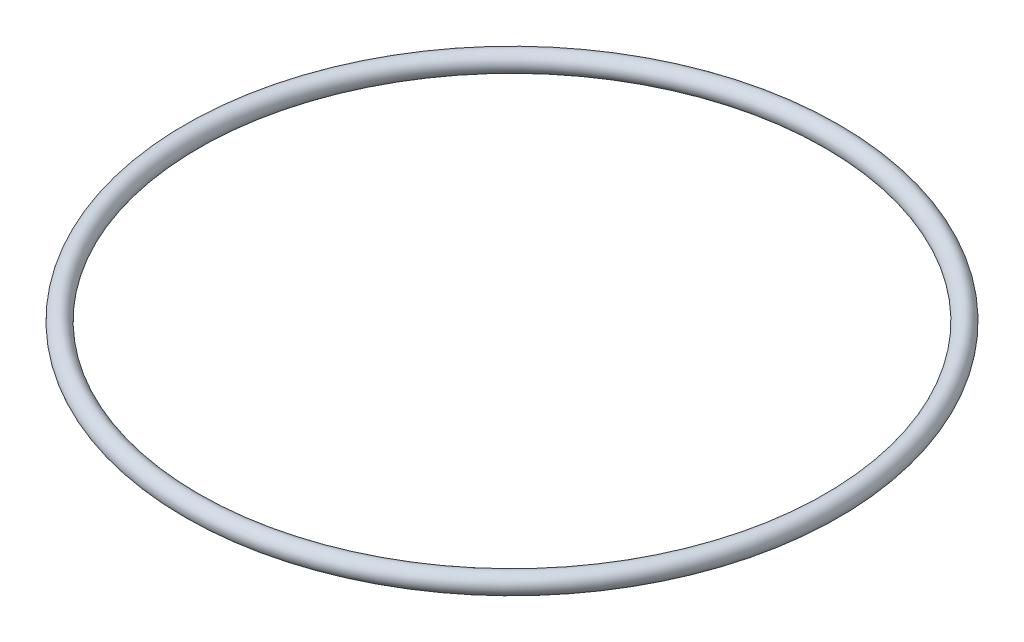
from build123d import *

# Parameters (mm, degrees)
SKETCH3_R = 1.524


with BuildPart() as part:
    # Sweep2: sweep along a path in Sketch4
    with BuildLine(Plane(origin=(0, 0, 0), x_dir=(1, 0, 0), z_dir=(0, 1, 0))) as sweep2_path:
        CenterArc((0, 0), 50.8, 0, 360)
    # Sketch3 → Sweep2 (sweep)
    with BuildSketch(Plane(origin=(0, 0, 0), x_dir=(0, 0, -1), z_dir=(1, 0, 0))):
        with Locations((-50.8, 0)):
            Circle(SKETCH3_R)
    sweep(path=sweep2_path.line)


solid = part.part
